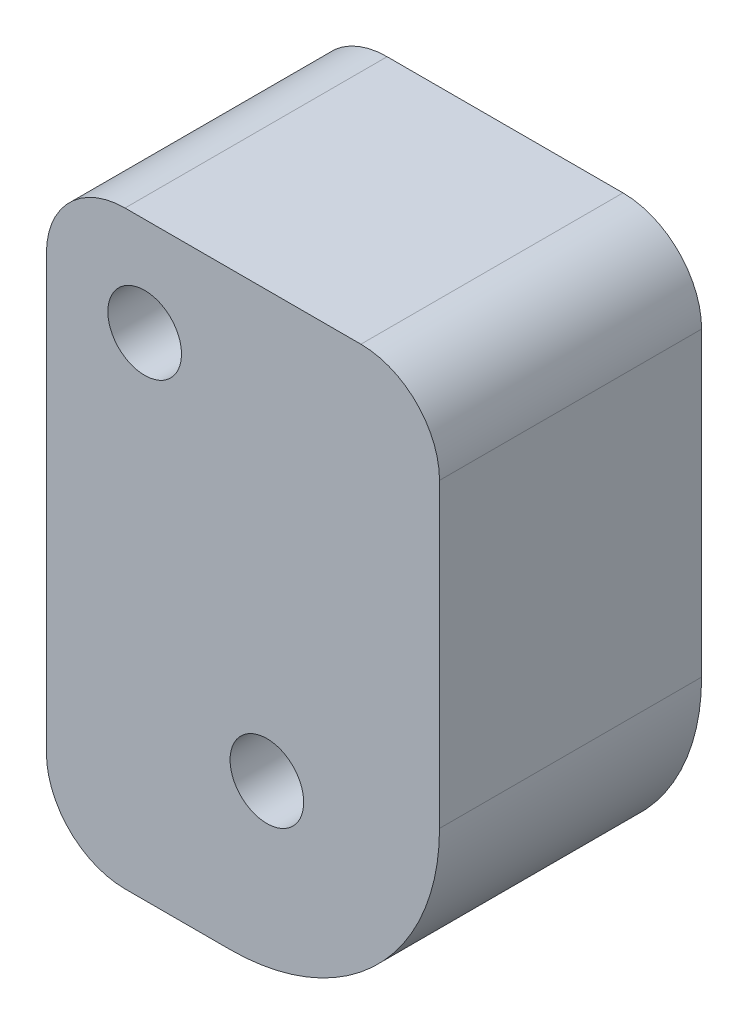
from build123d import *

# Parameters (mm, degrees)
BOSS_EXTRUDE1_DEPTH = 25.4
HOLE1_D             = 7.1374
HOLE1_CBORE_D       = 10.7188
HOLE1_CBORE_DEPTH   = 8.89


with BuildPart() as part:
    # Sketch1 → Boss-Extrude1 (new body)
    with BuildSketch(Plane(origin=(0, 0, 3.2), x_dir=(-1, 0, 0), z_dir=(0, 0, -1))):
        with BuildLine():
            Line((513.461, 10.212159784), (536.321, 10.212159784))
            ThreePointArc((536.321, 10.212159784), (541.709153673, 7.980313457), (543.941, 2.592159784))
            Line((543.941, 2.592159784), (543.941, -39.317840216))
            ThreePointArc((543.941, -39.317840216), (541.709153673, -44.705993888), (536.321, -46.937840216))
            Line((536.321, -46.937840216), (526.161, -46.937840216))
            ThreePointArc((526.161, -46.937840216), (511.792590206, -40.986250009), (505.841, -26.617840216))
            Line((505.841, -26.617840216), (505.841, 2.592159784))
            ThreePointArc((505.841, 2.592159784), (508.072846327, 7.980313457), (513.461, 10.212159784))
        make_face()
    extrude(amount=-BOSS_EXTRUDE1_DEPTH)

    # Hole1 (through all)
    with Locations(Plane(origin=(-509.703688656, -29.70118068, 3.2), x_dir=(-1, 0, 0), z_dir=(0, 0, -1))):
        with Locations((12.869107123, -1.307411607), (24.712311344, 30.388340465)):
            CounterBoreHole(HOLE1_D / 2, HOLE1_CBORE_D / 2, HOLE1_CBORE_DEPTH)


solid = part.part
